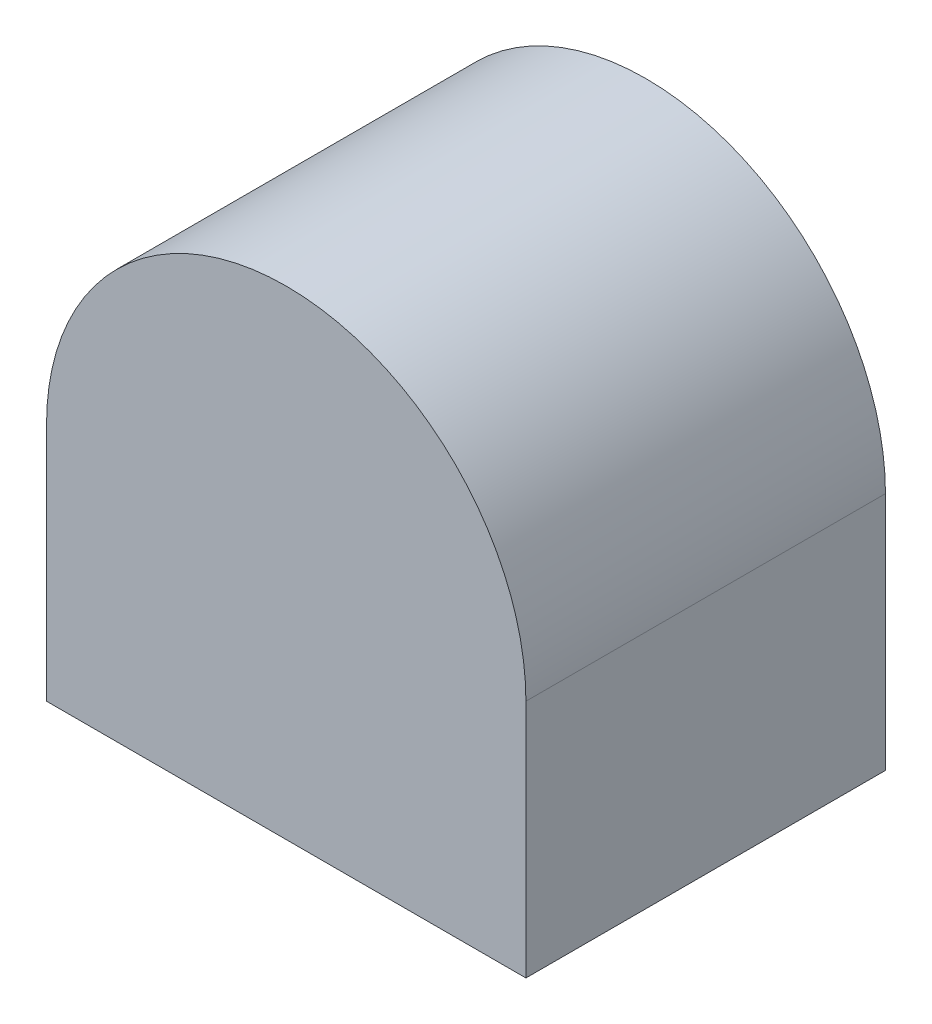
ISO-10303-21;
HEADER;
FILE_DESCRIPTION(('STEP AP214'),'2;1');
FILE_NAME('part.step','',(''),(''),'','','');
FILE_SCHEMA(('AUTOMOTIVE_DESIGN { 1 0 10303 214 1 1 1 1 }'));
ENDSEC;
DATA;
#1=APPLICATION_CONTEXT('core data for automotive mechanical design processes');
#2=APPLICATION_PROTOCOL_DEFINITION('international standard','automotive_design',2000,#1);
#3=PRODUCT_CONTEXT('',#1,'mechanical');
#4=PRODUCT('Part','Part','',(#3));
#5=PRODUCT_RELATED_PRODUCT_CATEGORY('part','',(#4));
#6=PRODUCT_DEFINITION_FORMATION('','',#4);
#7=PRODUCT_DEFINITION_CONTEXT('part definition',#1,'design');
#8=PRODUCT_DEFINITION('design','',#6,#7);
#9=PRODUCT_DEFINITION_SHAPE('','',#8);
#10=(LENGTH_UNIT() NAMED_UNIT(*) SI_UNIT(.MILLI.,.METRE.));
#11=(NAMED_UNIT(*) PLANE_ANGLE_UNIT() SI_UNIT($,.RADIAN.));
#12=(NAMED_UNIT(*) SI_UNIT($,.STERADIAN.) SOLID_ANGLE_UNIT());
#13=UNCERTAINTY_MEASURE_WITH_UNIT(LENGTH_MEASURE(1.E-05),#10,'distance_accuracy_value','');
#14=(GEOMETRIC_REPRESENTATION_CONTEXT(3) GLOBAL_UNCERTAINTY_ASSIGNED_CONTEXT((#13)) GLOBAL_UNIT_ASSIGNED_CONTEXT((#10,
#11,#12)) REPRESENTATION_CONTEXT('',''));
#15=CARTESIAN_POINT('',(0.,0.,0.));
#16=DIRECTION('',(0.,0.,1.));
#17=DIRECTION('',(1.,0.,0.));
#18=AXIS2_PLACEMENT_3D('',#15,#16,#17);
#19=CARTESIAN_POINT('',(0.,50.,37.5));
#20=DIRECTION('',(0.,0.,-1.));
#21=DIRECTION('',(-1.,0.,0.));
#22=AXIS2_PLACEMENT_3D('',#19,#20,#21);
#23=CYLINDRICAL_SURFACE('',#22,50.);
#24=DIRECTION('',(0.,0.,-1.));
#25=VECTOR('',#24,1.);
#26=CARTESIAN_POINT('',(-50.,50.,37.5));
#27=LINE('',#26,#25);
#28=CARTESIAN_POINT('',(-50.,50.,37.5));
#29=VERTEX_POINT('',#28);
#30=CARTESIAN_POINT('',(-50.,50.,-37.5));
#31=VERTEX_POINT('',#30);
#32=EDGE_CURVE('E90',#29,#31,#27,.T.);
#33=ORIENTED_EDGE('',*,*,#32,.F.);
#34=CARTESIAN_POINT('',(0.,50.,37.5));
#35=DIRECTION('',(0.,0.,1.));
#36=DIRECTION('',(1.,0.,0.));
#37=AXIS2_PLACEMENT_3D('',#34,#35,#36);
#38=CIRCLE('',#37,50.);
#39=CARTESIAN_POINT('',(50.,50.,37.5));
#40=VERTEX_POINT('',#39);
#41=EDGE_CURVE('E43',#40,#29,#38,.T.);
#42=ORIENTED_EDGE('',*,*,#41,.F.);
#43=DIRECTION('',(0.,0.,-1.));
#44=VECTOR('',#43,1.);
#45=CARTESIAN_POINT('',(50.,50.,37.5));
#46=LINE('',#45,#44);
#47=CARTESIAN_POINT('',(50.,50.,-37.5));
#48=VERTEX_POINT('',#47);
#49=EDGE_CURVE('E107',#48,#40,#46,.F.);
#50=ORIENTED_EDGE('',*,*,#49,.F.);
#51=CARTESIAN_POINT('',(0.,50.,-37.5));
#52=DIRECTION('',(0.,0.,1.));
#53=DIRECTION('',(1.,0.,0.));
#54=AXIS2_PLACEMENT_3D('',#51,#52,#53);
#55=CIRCLE('',#54,50.);
#56=EDGE_CURVE('E11',#31,#48,#55,.F.);
#57=ORIENTED_EDGE('',*,*,#56,.F.);
#58=EDGE_LOOP('',(#33,#42,#50,#57));
#59=FACE_BOUND('',#58,.T.);
#60=ADVANCED_FACE('F35',(#59),#23,.T.);
#61=CARTESIAN_POINT('',(-50.,100.,37.5));
#62=DIRECTION('',(1.,0.,0.));
#63=DIRECTION('',(0.,1.,0.));
#64=AXIS2_PLACEMENT_3D('',#61,#62,#63);
#65=PLANE('',#64);
#66=DIRECTION('',(0.,-1.,0.));
#67=VECTOR('',#66,1.);
#68=CARTESIAN_POINT('',(-50.,100.,37.5));
#69=LINE('',#68,#67);
#70=CARTESIAN_POINT('',(-50.,0.,37.5));
#71=VERTEX_POINT('',#70);
#72=EDGE_CURVE('E73',#29,#71,#69,.T.);
#73=ORIENTED_EDGE('',*,*,#72,.F.);
#74=ORIENTED_EDGE('',*,*,#32,.T.);
#75=DIRECTION('',(0.,-1.,0.));
#76=VECTOR('',#75,1.);
#77=CARTESIAN_POINT('',(-50.,100.,-37.5));
#78=LINE('',#77,#76);
#79=CARTESIAN_POINT('',(-50.,0.,-37.5));
#80=VERTEX_POINT('',#79);
#81=EDGE_CURVE('E87',#31,#80,#78,.T.);
#82=ORIENTED_EDGE('',*,*,#81,.T.);
#83=DIRECTION('',(0.,0.,-1.));
#84=VECTOR('',#83,1.);
#85=CARTESIAN_POINT('',(-50.,0.,37.5));
#86=LINE('',#85,#84);
#87=EDGE_CURVE('E85',#71,#80,#86,.T.);
#88=ORIENTED_EDGE('',*,*,#87,.F.);
#89=EDGE_LOOP('',(#73,#74,#82,#88));
#90=FACE_BOUND('',#89,.T.);
#91=ADVANCED_FACE('F86',(#90),#65,.F.);
#92=CARTESIAN_POINT('',(-50.,0.,37.5));
#93=DIRECTION('',(0.,1.,0.));
#94=DIRECTION('',(0.,0.,1.));
#95=AXIS2_PLACEMENT_3D('',#92,#93,#94);
#96=PLANE('',#95);
#97=DIRECTION('',(1.,0.,0.));
#98=VECTOR('',#97,1.);
#99=CARTESIAN_POINT('',(-50.,0.,-37.5));
#100=LINE('',#99,#98);
#101=CARTESIAN_POINT('',(50.,0.,-37.5));
#102=VERTEX_POINT('',#101);
#103=EDGE_CURVE('E101',#80,#102,#100,.T.);
#104=ORIENTED_EDGE('',*,*,#103,.T.);
#105=DIRECTION('',(0.,0.,-1.));
#106=VECTOR('',#105,1.);
#107=CARTESIAN_POINT('',(50.,0.,37.5));
#108=LINE('',#107,#106);
#109=CARTESIAN_POINT('',(50.,0.,37.5));
#110=VERTEX_POINT('',#109);
#111=EDGE_CURVE('E91',#110,#102,#108,.T.);
#112=ORIENTED_EDGE('',*,*,#111,.F.);
#113=DIRECTION('',(1.,0.,0.));
#114=VECTOR('',#113,1.);
#115=CARTESIAN_POINT('',(-50.,0.,37.5));
#116=LINE('',#115,#114);
#117=EDGE_CURVE('E78',#71,#110,#116,.T.);
#118=ORIENTED_EDGE('',*,*,#117,.F.);
#119=ORIENTED_EDGE('',*,*,#87,.T.);
#120=EDGE_LOOP('',(#104,#112,#118,#119));
#121=FACE_BOUND('',#120,.T.);
#122=ADVANCED_FACE('F93',(#121),#96,.F.);
#123=CARTESIAN_POINT('',(50.,0.,37.5));
#124=DIRECTION('',(-1.,0.,0.));
#125=DIRECTION('',(0.,-1.,0.));
#126=AXIS2_PLACEMENT_3D('',#123,#124,#125);
#127=PLANE('',#126);
#128=DIRECTION('',(0.,1.,0.));
#129=VECTOR('',#128,1.);
#130=CARTESIAN_POINT('',(50.,0.,-37.5));
#131=LINE('',#130,#129);
#132=EDGE_CURVE('E82',#102,#48,#131,.T.);
#133=ORIENTED_EDGE('',*,*,#132,.T.);
#134=ORIENTED_EDGE('',*,*,#49,.T.);
#135=DIRECTION('',(0.,1.,0.));
#136=VECTOR('',#135,1.);
#137=CARTESIAN_POINT('',(50.,0.,37.5));
#138=LINE('',#137,#136);
#139=EDGE_CURVE('E96',#110,#40,#138,.T.);
#140=ORIENTED_EDGE('',*,*,#139,.F.);
#141=ORIENTED_EDGE('',*,*,#111,.T.);
#142=EDGE_LOOP('',(#133,#134,#140,#141));
#143=FACE_BOUND('',#142,.T.);
#144=ADVANCED_FACE('F109',(#143),#127,.F.);
#145=CARTESIAN_POINT('',(50.,100.,37.5));
#146=DIRECTION('',(0.,0.,1.));
#147=DIRECTION('',(1.,0.,0.));
#148=AXIS2_PLACEMENT_3D('',#145,#146,#147);
#149=PLANE('',#148);
#150=ORIENTED_EDGE('',*,*,#139,.T.);
#151=ORIENTED_EDGE('',*,*,#41,.T.);
#152=ORIENTED_EDGE('',*,*,#72,.T.);
#153=ORIENTED_EDGE('',*,*,#117,.T.);
#154=EDGE_LOOP('',(#150,#151,#152,#153));
#155=FACE_BOUND('',#154,.T.);
#156=ADVANCED_FACE('F76',(#155),#149,.T.);
#157=CARTESIAN_POINT('',(50.,100.,-37.5));
#158=DIRECTION('',(0.,0.,1.));
#159=DIRECTION('',(1.,0.,0.));
#160=AXIS2_PLACEMENT_3D('',#157,#158,#159);
#161=PLANE('',#160);
#162=ORIENTED_EDGE('',*,*,#81,.F.);
#163=ORIENTED_EDGE('',*,*,#56,.T.);
#164=ORIENTED_EDGE('',*,*,#132,.F.);
#165=ORIENTED_EDGE('',*,*,#103,.F.);
#166=EDGE_LOOP('',(#162,#163,#164,#165));
#167=FACE_BOUND('',#166,.T.);
#168=ADVANCED_FACE('F110',(#167),#161,.F.);
#169=CLOSED_SHELL('',(#60,#91,#122,#144,#156,#168));
#170=MANIFOLD_SOLID_BREP('B2',#169);
#171=ADVANCED_BREP_SHAPE_REPRESENTATION('',(#18,#170),#14);
#172=SHAPE_DEFINITION_REPRESENTATION(#9,#171);
ENDSEC;
END-ISO-10303-21;
